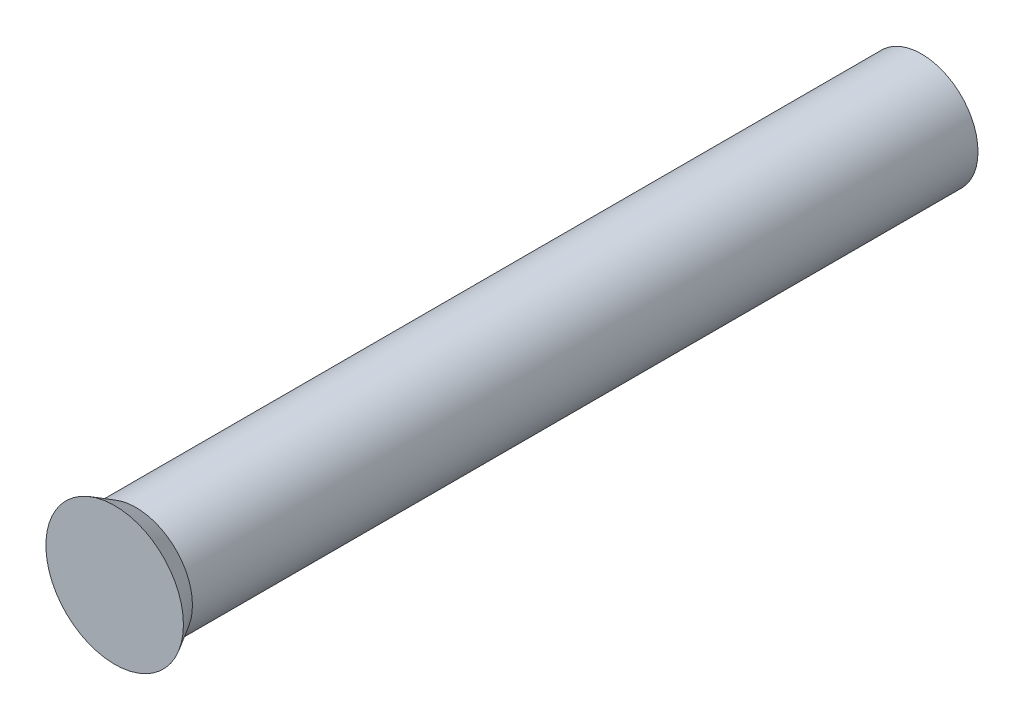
from build123d import *

# Parameters (mm, degrees)
SKETCH2_R           = 1.397
BOSS_EXTRUDE1_DEPTH = 19.812


with BuildPart() as part:
    # Sketch2 → Boss-Extrude1 (new body)
    with BuildSketch(Plane.XY):
        Circle(SKETCH2_R)
    extrude(amount=BOSS_EXTRUDE1_DEPTH)

    # Sketch3 → Cut-Revolve3 (revolve, cut)
    with BuildSketch(Plane(origin=(0, 0, 0), x_dir=(0, 0, -1), z_dir=(1, 0, 0)), mode=Mode.PRIVATE) as cut_revolve3_sk:
        with BuildLine():
            Line((-0.374325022, 1.397), (0.800761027, 1.397))
            Line((0.800761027, 1.397), (0.800761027, 0))
            Line((0.800761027, 0), (0, 0))
            ThreePointArc((0, 0), (-0.095203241, 0.723140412), (-0.374325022, 1.397))
        make_face()
    revolve(cut_revolve3_sk.sketch.rotate(Axis((0, 0, 2.794), (0, 0, -1)), 90), axis=Axis((0, 0, 2.794), (0, 0, -1)), mode=Mode.SUBTRACT)

    # Sketch4 → Revolve1 (revolve)
    with BuildSketch(Plane(origin=(0, 0, 0), x_dir=(0, 0, -1), z_dir=(1, 0, 0))):
        Polygon((-19.812, 1.397), (-20.339929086, 1.7018), (-20.339929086, 0), (-19.812, 0), align=None)
    revolve(axis=Axis((0, 0, 2.794), (0, 0, -1)))


solid = part.part
